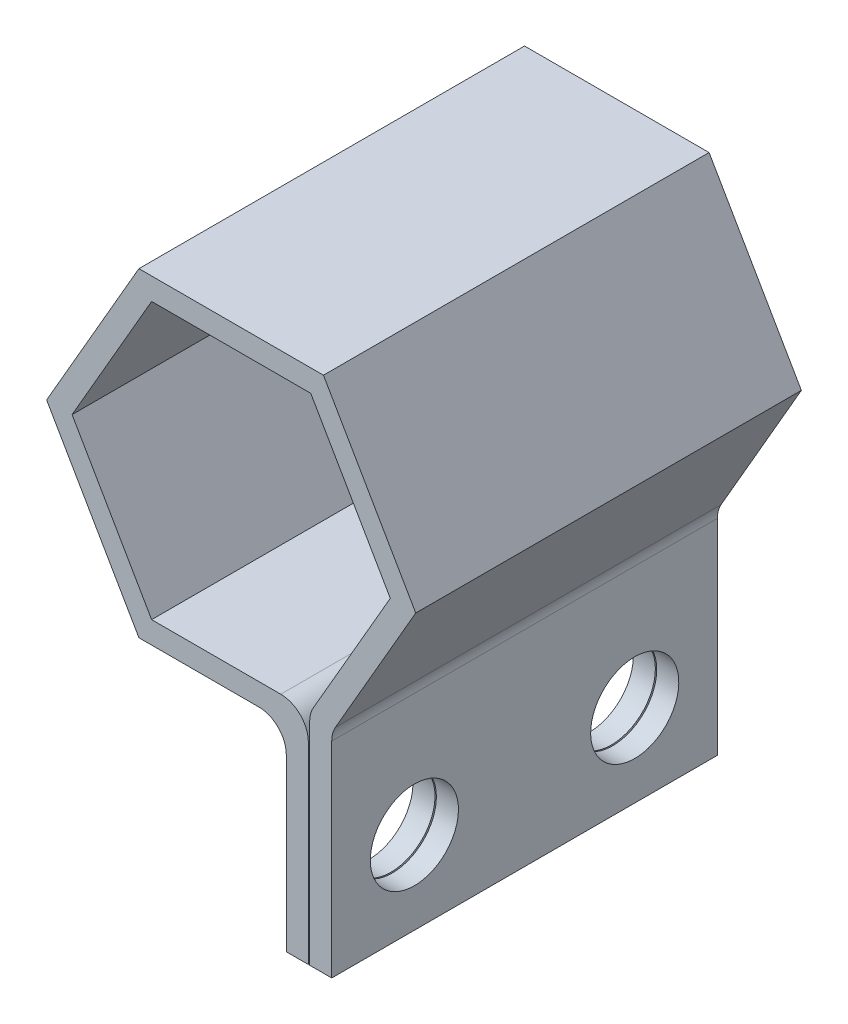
from build123d import *

# Parameters (mm, degrees)
BOSS_EXTRUDE1_DEPTH = 14
CUT_EXTRUDE1_REACH  = 23.728
SKETCH2_R           = 1.6


with BuildPart() as part:
    # Sketch1 → Boss-Extrude1 (new body)
    with BuildSketch(Plane.XY):
        with BuildLine():
            Line((-2.888119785, 5.002370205), (-5.776239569, 0))
            Line((-5.776239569, 0), (-2.888119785, -5.002370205))
            Line((-2.888119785, -5.002370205), (1.8, -5.002370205))
            ThreePointArc((1.8, -5.002370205), (2.507106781, -5.295263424), (2.8, -6.002370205))
            Line((2.8, -6.002370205), (2.8, -13))
            Line((2.8, -13), (2, -13))
            Line((2, -13), (2, -6.802370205))
            ThreePointArc((2, -6.802370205), (1.707106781, -6.095263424), (1, -5.802370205))
            Line((1, -5.802370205), (-3.35, -5.802370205))
            Line((-3.35, -5.802370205), (-6.7, 0))
            Line((-6.7, 0), (-3.35, 5.802370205))
            Line((-3.35, 5.802370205), (3.35, 5.802370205))
            Line((3.35, 5.802370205), (6.7, 0))
            Line((6.7, 0), (3.783974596, -5.050704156))
            ThreePointArc((3.783974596, -5.050704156), (3.684074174, -5.29188511), (3.65, -5.550704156))
            Line((3.65, -5.550704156), (3.65, -13))
            Line((3.65, -13), (2.85, -13))
            Line((2.85, -13), (2.85, -5.336344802))
            ThreePointArc((2.85, -5.336344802), (2.884074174, -5.077525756), (2.983974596, -4.836344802))
            Line((2.983974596, -4.836344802), (5.776239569, 0))
            Line((5.776239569, 0), (2.888119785, 5.002370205))
            Line((2.888119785, 5.002370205), (-2.888119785, 5.002370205))
        make_face()
    extrude(amount=BOSS_EXTRUDE1_DEPTH)

    # Cut-Extrude1: up to this face of the body (flat: up to its plane)
    cut_extrude1_end = Plane(part.part.faces().sort_by_distance((2, -9.901185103, 7))[0])
    # Sketch2 → Cut-Extrude1 (cut, up to the picked face)
    with BuildSketch(Plane(origin=(3.65, 0, 0), x_dir=(0, 0, -1), z_dir=(1, 0, 0)), mode=Mode.PRIVATE) as cut_extrude1_sk1:
        with Locations(Location((-11, -10, 0), (0, 0, 90))):
            Circle(SKETCH2_R)
    cut_extrude1_tool1 = split(extrude(cut_extrude1_sk1.sketch, amount=-CUT_EXTRUDE1_REACH, mode=Mode.PRIVATE), bisect_by=cut_extrude1_end, keep=Keep.BOTH, mode=Mode.PRIVATE)
    # Sketch2 → Cut-Extrude1 (cut, up to the picked face)
    with BuildSketch(Plane(origin=(3.65, 0, 0), x_dir=(0, 0, -1), z_dir=(1, 0, 0)), mode=Mode.PRIVATE) as cut_extrude1_sk2:
        with Locations(Location((-3, -10, 0), (0, 0, 90))):
            Circle(SKETCH2_R)
    cut_extrude1_tool2 = split(extrude(cut_extrude1_sk2.sketch, amount=-CUT_EXTRUDE1_REACH, mode=Mode.PRIVATE), bisect_by=cut_extrude1_end, keep=Keep.BOTH, mode=Mode.PRIVATE)
    add(cut_extrude1_tool1.solids().sort_by(Axis((3.65, -10, 11), (-1, 0, 0)))[0], mode=Mode.SUBTRACT)
    add(cut_extrude1_tool2.solids().sort_by(Axis((3.65, -10, 3), (-1, 0, 0)))[0], mode=Mode.SUBTRACT)


solid = part.part
